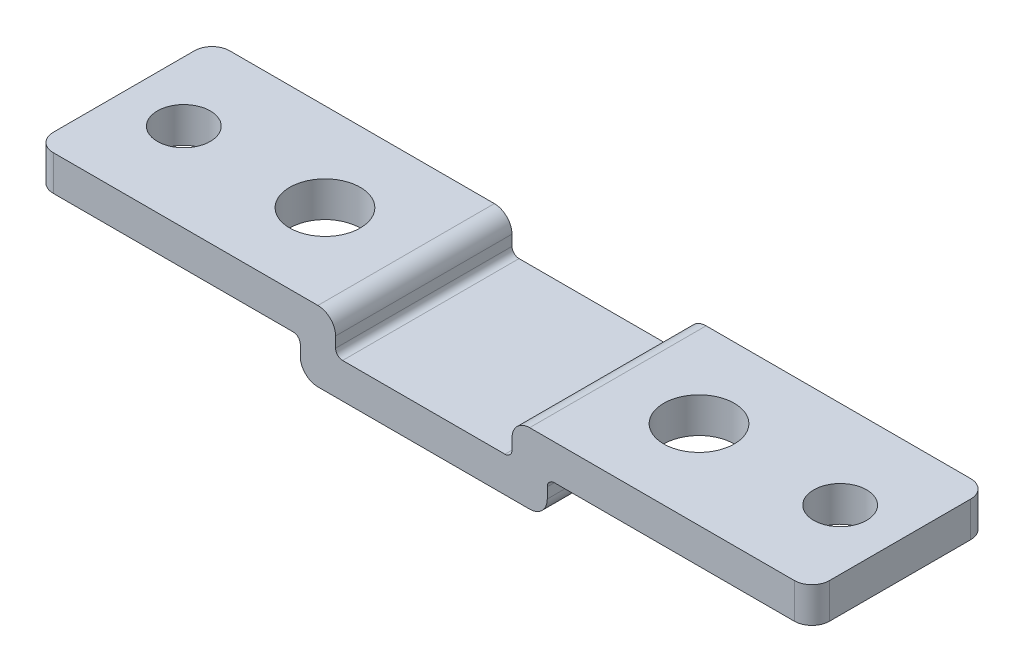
from build123d import *

# Parameters (mm, degrees)
EXTRUSION1_DEPTH        = 5
CONG_1_R                = 0.5
ESQUISSE2_R             = 1
ESQUISSE2_R_2           = 0.75
ENL_V_MAT_EXTRU_1_DEPTH = 25.91622974


with BuildPart() as part:
    # Esquisse1 → Extrusion1 (new body)
    with BuildSketch(Plane.XY):
        with BuildLine():
            Line((-13.327320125, 2.787486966), (-16.327320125, 2.787486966))
            ThreePointArc((-16.327320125, 2.787486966), (-16.680873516, 2.933933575), (-16.827320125, 3.287486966))
            Line((-16.827320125, 3.287486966), (-16.827320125, 3.587486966))
            ThreePointArc((-16.827320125, 3.587486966), (-16.885898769, 3.728908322), (-17.027320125, 3.787486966))
            Line((-17.027320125, 3.787486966), (-24.327320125, 3.787486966))
            Line((-24.327320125, 3.787486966), (-24.327320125, 4.787486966))
            Line((-24.327320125, 4.787486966), (-16.327320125, 4.787486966))
            ThreePointArc((-16.327320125, 4.787486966), (-15.973766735, 4.641040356), (-15.827320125, 4.287486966))
            Line((-15.827320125, 4.287486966), (-15.827320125, 3.987486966))
            ThreePointArc((-15.827320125, 3.987486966), (-15.768741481, 3.846065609), (-15.627320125, 3.787486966))
            Line((-15.627320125, 3.787486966), (-13.327320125, 3.787486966))
            Line((-13.327320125, 3.787486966), (-13.327320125, 2.787486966))
        make_face()
    extrude(amount=EXTRUSION1_DEPTH)

    # Cong_1
    cong_1_edges = [part.edges().sort_by_distance(p)[0] for p in [
        (-24.327320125, 4.287486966, 0),
        (-24.327320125, 4.287486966, 5),
    ]]
    fillet(cong_1_edges, radius=CONG_1_R)

    # Esquisse2 → Enl_v. mat.-Extru.1 (cut, through all)
    with BuildSketch(Plane(origin=(0, 4.787486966, 0), x_dir=(-1, 0, 0), z_dir=(0, 1, 0))):
        with Locations(Location((18.627320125, 2.5, 0), (0, 0, 90))):
            Circle(ESQUISSE2_R)
        with Locations(Location((22.627320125, 2.5, 0), (0, 0, 90))):
            Circle(ESQUISSE2_R_2)
    extrude(amount=-ENL_V_MAT_EXTRU_1_DEPTH, mode=Mode.SUBTRACT)

    # Sym_trie1: part across plane


with BuildPart() as part_1:
    add(part.part)
    add(part.part.mirror(Plane(origin=(-13.327320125, 3.787486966, 5), x_dir=(0, 0, 1), z_dir=(-1, 0, 0))))


solid = part_1.part
